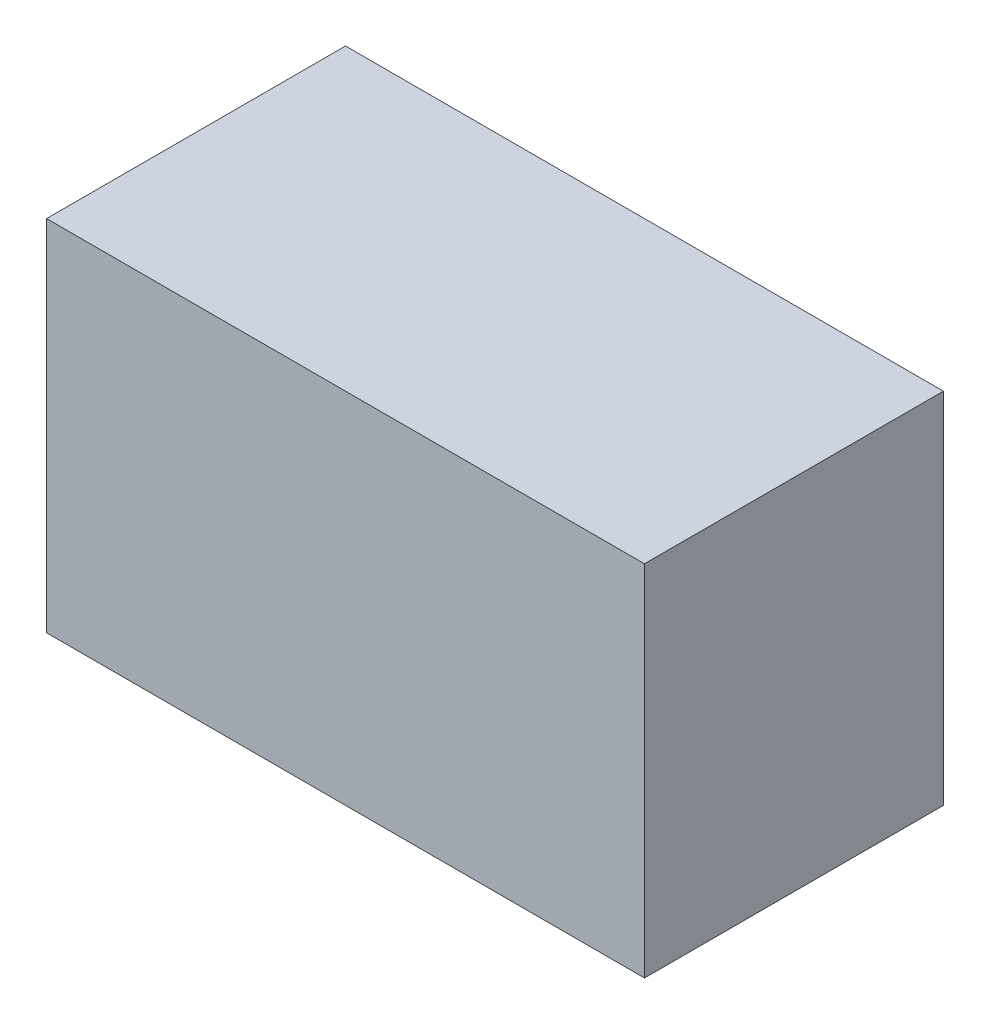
ISO-10303-21;
HEADER;
FILE_DESCRIPTION(('STEP AP214'),'2;1');
FILE_NAME('part.step','',(''),(''),'','','');
FILE_SCHEMA(('AUTOMOTIVE_DESIGN { 1 0 10303 214 1 1 1 1 }'));
ENDSEC;
DATA;
#1=APPLICATION_CONTEXT('core data for automotive mechanical design processes');
#2=APPLICATION_PROTOCOL_DEFINITION('international standard','automotive_design',2000,#1);
#3=PRODUCT_CONTEXT('',#1,'mechanical');
#4=PRODUCT('Part','Part','',(#3));
#5=PRODUCT_RELATED_PRODUCT_CATEGORY('part','',(#4));
#6=PRODUCT_DEFINITION_FORMATION('','',#4);
#7=PRODUCT_DEFINITION_CONTEXT('part definition',#1,'design');
#8=PRODUCT_DEFINITION('design','',#6,#7);
#9=PRODUCT_DEFINITION_SHAPE('','',#8);
#10=(LENGTH_UNIT() NAMED_UNIT(*) SI_UNIT(.MILLI.,.METRE.));
#11=(NAMED_UNIT(*) PLANE_ANGLE_UNIT() SI_UNIT($,.RADIAN.));
#12=(NAMED_UNIT(*) SI_UNIT($,.STERADIAN.) SOLID_ANGLE_UNIT());
#13=UNCERTAINTY_MEASURE_WITH_UNIT(LENGTH_MEASURE(1.E-05),#10,'distance_accuracy_value','');
#14=(GEOMETRIC_REPRESENTATION_CONTEXT(3) GLOBAL_UNCERTAINTY_ASSIGNED_CONTEXT((#13)) GLOBAL_UNIT_ASSIGNED_CONTEXT((#10,
#11,#12)) REPRESENTATION_CONTEXT('',''));
#15=CARTESIAN_POINT('',(0.,0.,0.));
#16=DIRECTION('',(0.,0.,1.));
#17=DIRECTION('',(1.,0.,0.));
#18=AXIS2_PLACEMENT_3D('',#15,#16,#17);
#19=CARTESIAN_POINT('',(-15.,9.,15.));
#20=DIRECTION('',(1.,0.,0.));
#21=DIRECTION('',(0.,0.,-1.));
#22=AXIS2_PLACEMENT_3D('',#19,#20,#21);
#23=PLANE('',#22);
#24=DIRECTION('',(0.,-1.,0.));
#25=VECTOR('',#24,1.);
#26=CARTESIAN_POINT('',(-15.,9.,0.));
#27=LINE('',#26,#25);
#28=CARTESIAN_POINT('',(-15.,9.,0.));
#29=VERTEX_POINT('',#28);
#30=CARTESIAN_POINT('',(-15.,-9.,0.));
#31=VERTEX_POINT('',#30);
#32=EDGE_CURVE('E77',#29,#31,#27,.T.);
#33=ORIENTED_EDGE('',*,*,#32,.T.);
#34=DIRECTION('',(0.,0.,-1.));
#35=VECTOR('',#34,1.);
#36=CARTESIAN_POINT('',(-15.,-9.,15.));
#37=LINE('',#36,#35);
#38=CARTESIAN_POINT('',(-15.,-9.,15.));
#39=VERTEX_POINT('',#38);
#40=EDGE_CURVE('E11',#39,#31,#37,.T.);
#41=ORIENTED_EDGE('',*,*,#40,.F.);
#42=DIRECTION('',(0.,-1.,0.));
#43=VECTOR('',#42,1.);
#44=CARTESIAN_POINT('',(-15.,9.,15.));
#45=LINE('',#44,#43);
#46=CARTESIAN_POINT('',(-15.,9.,15.));
#47=VERTEX_POINT('',#46);
#48=EDGE_CURVE('E95',#47,#39,#45,.T.);
#49=ORIENTED_EDGE('',*,*,#48,.F.);
#50=DIRECTION('',(0.,0.,-1.));
#51=VECTOR('',#50,1.);
#52=CARTESIAN_POINT('',(-15.,9.,15.));
#53=LINE('',#52,#51);
#54=EDGE_CURVE('E89',#47,#29,#53,.T.);
#55=ORIENTED_EDGE('',*,*,#54,.T.);
#56=EDGE_LOOP('',(#33,#41,#49,#55));
#57=FACE_BOUND('',#56,.T.);
#58=ADVANCED_FACE('F33',(#57),#23,.F.);
#59=CARTESIAN_POINT('',(-15.,-9.,15.));
#60=DIRECTION('',(0.,1.,0.));
#61=DIRECTION('',(0.,0.,1.));
#62=AXIS2_PLACEMENT_3D('',#59,#60,#61);
#63=PLANE('',#62);
#64=DIRECTION('',(1.,0.,0.));
#65=VECTOR('',#64,1.);
#66=CARTESIAN_POINT('',(-15.,-9.,0.));
#67=LINE('',#66,#65);
#68=CARTESIAN_POINT('',(15.,-9.,0.));
#69=VERTEX_POINT('',#68);
#70=EDGE_CURVE('E73',#31,#69,#67,.T.);
#71=ORIENTED_EDGE('',*,*,#70,.T.);
#72=DIRECTION('',(0.,0.,-1.));
#73=VECTOR('',#72,1.);
#74=CARTESIAN_POINT('',(15.,-9.,15.));
#75=LINE('',#74,#73);
#76=CARTESIAN_POINT('',(15.,-9.,15.));
#77=VERTEX_POINT('',#76);
#78=EDGE_CURVE('E40',#77,#69,#75,.T.);
#79=ORIENTED_EDGE('',*,*,#78,.F.);
#80=DIRECTION('',(1.,0.,0.));
#81=VECTOR('',#80,1.);
#82=CARTESIAN_POINT('',(-15.,-9.,15.));
#83=LINE('',#82,#81);
#84=EDGE_CURVE('E85',#39,#77,#83,.T.);
#85=ORIENTED_EDGE('',*,*,#84,.F.);
#86=ORIENTED_EDGE('',*,*,#40,.T.);
#87=EDGE_LOOP('',(#71,#79,#85,#86));
#88=FACE_BOUND('',#87,.T.);
#89=ADVANCED_FACE('F84',(#88),#63,.F.);
#90=CARTESIAN_POINT('',(15.,9.,15.));
#91=DIRECTION('',(-1.,0.,0.));
#92=DIRECTION('',(0.,0.,1.));
#93=AXIS2_PLACEMENT_3D('',#90,#91,#92);
#94=PLANE('',#93);
#95=DIRECTION('',(0.,1.,0.));
#96=VECTOR('',#95,1.);
#97=CARTESIAN_POINT('',(15.,9.,0.));
#98=LINE('',#97,#96);
#99=CARTESIAN_POINT('',(15.,9.,0.));
#100=VERTEX_POINT('',#99);
#101=EDGE_CURVE('E78',#69,#100,#98,.T.);
#102=ORIENTED_EDGE('',*,*,#101,.T.);
#103=DIRECTION('',(0.,0.,-1.));
#104=VECTOR('',#103,1.);
#105=CARTESIAN_POINT('',(15.,9.,15.));
#106=LINE('',#105,#104);
#107=CARTESIAN_POINT('',(15.,9.,15.));
#108=VERTEX_POINT('',#107);
#109=EDGE_CURVE('E101',#108,#100,#106,.T.);
#110=ORIENTED_EDGE('',*,*,#109,.F.);
#111=DIRECTION('',(0.,1.,0.));
#112=VECTOR('',#111,1.);
#113=CARTESIAN_POINT('',(15.,9.,15.));
#114=LINE('',#113,#112);
#115=EDGE_CURVE('E52',#77,#108,#114,.T.);
#116=ORIENTED_EDGE('',*,*,#115,.F.);
#117=ORIENTED_EDGE('',*,*,#78,.T.);
#118=EDGE_LOOP('',(#102,#110,#116,#117));
#119=FACE_BOUND('',#118,.T.);
#120=ADVANCED_FACE('F104',(#119),#94,.F.);
#121=CARTESIAN_POINT('',(-15.,9.,15.));
#122=DIRECTION('',(0.,-1.,0.));
#123=DIRECTION('',(0.,0.,-1.));
#124=AXIS2_PLACEMENT_3D('',#121,#122,#123);
#125=PLANE('',#124);
#126=DIRECTION('',(-1.,0.,0.));
#127=VECTOR('',#126,1.);
#128=CARTESIAN_POINT('',(-15.,9.,0.));
#129=LINE('',#128,#127);
#130=EDGE_CURVE('E93',#100,#29,#129,.T.);
#131=ORIENTED_EDGE('',*,*,#130,.T.);
#132=ORIENTED_EDGE('',*,*,#54,.F.);
#133=DIRECTION('',(-1.,0.,0.));
#134=VECTOR('',#133,1.);
#135=CARTESIAN_POINT('',(-15.,9.,15.));
#136=LINE('',#135,#134);
#137=EDGE_CURVE('E47',#108,#47,#136,.T.);
#138=ORIENTED_EDGE('',*,*,#137,.F.);
#139=ORIENTED_EDGE('',*,*,#109,.T.);
#140=EDGE_LOOP('',(#131,#132,#138,#139));
#141=FACE_BOUND('',#140,.T.);
#142=ADVANCED_FACE('F106',(#141),#125,.F.);
#143=CARTESIAN_POINT('',(-15.,-9.,15.));
#144=DIRECTION('',(0.,0.,1.));
#145=DIRECTION('',(1.,0.,0.));
#146=AXIS2_PLACEMENT_3D('',#143,#144,#145);
#147=PLANE('',#146);
#148=ORIENTED_EDGE('',*,*,#48,.T.);
#149=ORIENTED_EDGE('',*,*,#84,.T.);
#150=ORIENTED_EDGE('',*,*,#115,.T.);
#151=ORIENTED_EDGE('',*,*,#137,.T.);
#152=EDGE_LOOP('',(#148,#149,#150,#151));
#153=FACE_BOUND('',#152,.T.);
#154=ADVANCED_FACE('F107',(#153),#147,.T.);
#155=CARTESIAN_POINT('',(-15.,-9.,0.));
#156=DIRECTION('',(0.,0.,1.));
#157=DIRECTION('',(1.,0.,0.));
#158=AXIS2_PLACEMENT_3D('',#155,#156,#157);
#159=PLANE('',#158);
#160=ORIENTED_EDGE('',*,*,#32,.F.);
#161=ORIENTED_EDGE('',*,*,#130,.F.);
#162=ORIENTED_EDGE('',*,*,#101,.F.);
#163=ORIENTED_EDGE('',*,*,#70,.F.);
#164=EDGE_LOOP('',(#160,#161,#162,#163));
#165=FACE_BOUND('',#164,.T.);
#166=ADVANCED_FACE('F74',(#165),#159,.F.);
#167=CLOSED_SHELL('',(#58,#89,#120,#142,#154,#166));
#168=MANIFOLD_SOLID_BREP('B2',#167);
#169=ADVANCED_BREP_SHAPE_REPRESENTATION('',(#18,#168),#14);
#170=SHAPE_DEFINITION_REPRESENTATION(#9,#169);
ENDSEC;
END-ISO-10303-21;
